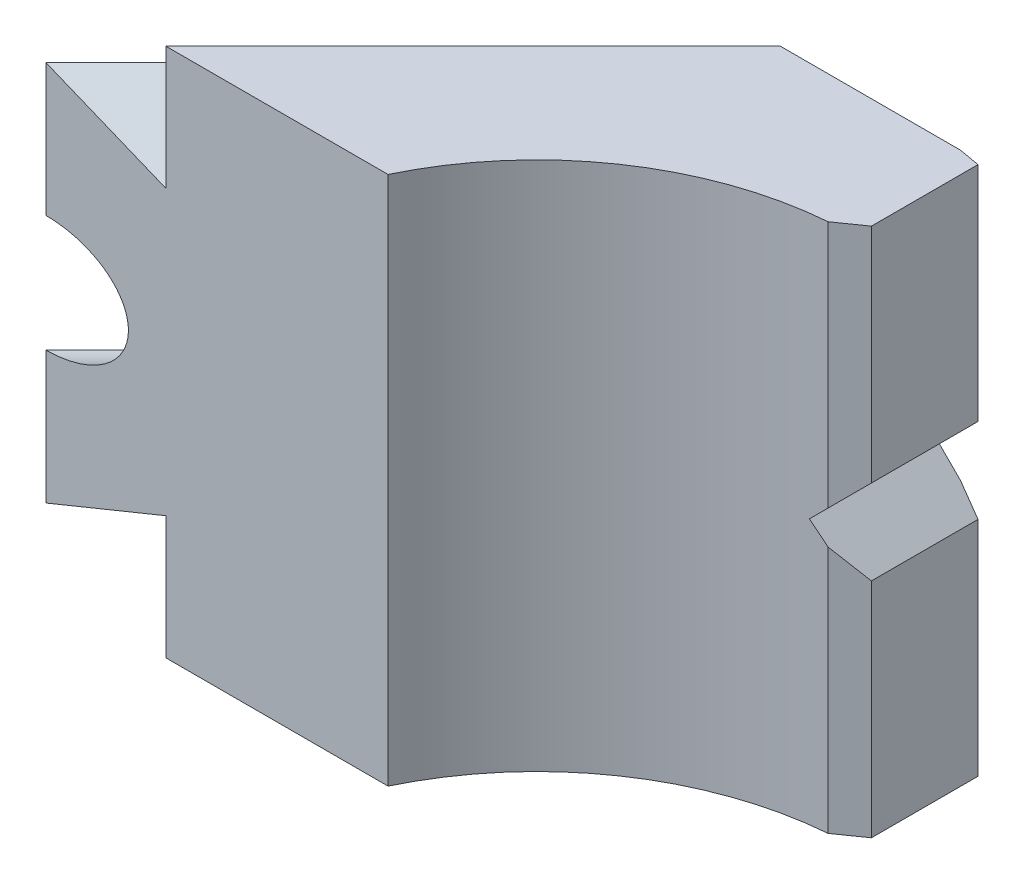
ISO-10303-21;
HEADER;
FILE_DESCRIPTION(('STEP AP214'),'2;1');
FILE_NAME('part.step','',(''),(''),'','','');
FILE_SCHEMA(('AUTOMOTIVE_DESIGN { 1 0 10303 214 1 1 1 1 }'));
ENDSEC;
DATA;
#1=APPLICATION_CONTEXT('core data for automotive mechanical design processes');
#2=APPLICATION_PROTOCOL_DEFINITION('international standard','automotive_design',2000,#1);
#3=PRODUCT_CONTEXT('',#1,'mechanical');
#4=PRODUCT('Part','Part','',(#3));
#5=PRODUCT_RELATED_PRODUCT_CATEGORY('part','',(#4));
#6=PRODUCT_DEFINITION_FORMATION('','',#4);
#7=PRODUCT_DEFINITION_CONTEXT('part definition',#1,'design');
#8=PRODUCT_DEFINITION('design','',#6,#7);
#9=PRODUCT_DEFINITION_SHAPE('','',#8);
#10=(LENGTH_UNIT() NAMED_UNIT(*) SI_UNIT(.MILLI.,.METRE.));
#11=(NAMED_UNIT(*) PLANE_ANGLE_UNIT() SI_UNIT($,.RADIAN.));
#12=(NAMED_UNIT(*) SI_UNIT($,.STERADIAN.) SOLID_ANGLE_UNIT());
#13=UNCERTAINTY_MEASURE_WITH_UNIT(LENGTH_MEASURE(1.E-05),#10,'distance_accuracy_value','');
#14=(GEOMETRIC_REPRESENTATION_CONTEXT(3) GLOBAL_UNCERTAINTY_ASSIGNED_CONTEXT((#13)) GLOBAL_UNIT_ASSIGNED_CONTEXT((#10,
#11,#12)) REPRESENTATION_CONTEXT('',''));
#15=CARTESIAN_POINT('',(0.,0.,0.));
#16=DIRECTION('',(0.,0.,1.));
#17=DIRECTION('',(1.,0.,0.));
#18=AXIS2_PLACEMENT_3D('',#15,#16,#17);
#19=CARTESIAN_POINT('',(-84.343578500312,6.69059892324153,90.0004329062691));
#20=DIRECTION('',(-0.707106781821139,0.,-0.707106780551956));
#21=DIRECTION('',(0.707106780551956,0.,-0.70710678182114));
#22=AXIS2_PLACEMENT_3D('',#19,#20,#21);
#23=PLANE('',#22);
#24=DIRECTION('',(0.,1.,0.));
#25=VECTOR('',#24,1.);
#26=CARTESIAN_POINT('',(5.65685424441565,12.5,0.));
#27=LINE('',#26,#25);
#28=CARTESIAN_POINT('',(5.65685424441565,6.69059892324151,0.));
#29=VERTEX_POINT('',#28);
#30=CARTESIAN_POINT('',(5.65685424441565,12.5,0.));
#31=VERTEX_POINT('',#30);
#32=EDGE_CURVE('E241',#29,#31,#27,.T.);
#33=ORIENTED_EDGE('',*,*,#32,.F.);
#34=DIRECTION('',(0.707106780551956,0.,-0.707106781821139));
#35=VECTOR('',#34,1.);
#36=CARTESIAN_POINT('',(-84.343578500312,6.69059892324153,90.0004329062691));
#37=LINE('',#36,#35);
#38=CARTESIAN_POINT('',(-8.8431457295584,6.69059892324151,14.5));
#39=VERTEX_POINT('',#38);
#40=EDGE_CURVE('E236',#39,#29,#37,.T.);
#41=ORIENTED_EDGE('',*,*,#40,.F.);
#42=DIRECTION('',(0.,-1.,0.));
#43=VECTOR('',#42,1.);
#44=CARTESIAN_POINT('',(-8.8431457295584,12.5,14.5));
#45=LINE('',#44,#43);
#46=CARTESIAN_POINT('',(-8.8431457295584,12.5,14.5));
#47=VERTEX_POINT('',#46);
#48=EDGE_CURVE('E229',#47,#39,#45,.T.);
#49=ORIENTED_EDGE('',*,*,#48,.F.);
#50=DIRECTION('',(-0.707106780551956,0.,0.70710678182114));
#51=VECTOR('',#50,1.);
#52=CARTESIAN_POINT('',(-0.0915728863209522,12.5,5.74842714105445));
#53=LINE('',#52,#51);
#54=EDGE_CURVE('E211',#31,#47,#53,.T.);
#55=ORIENTED_EDGE('',*,*,#54,.F.);
#56=EDGE_LOOP('',(#33,#41,#49,#55));
#57=FACE_BOUND('',#56,.T.);
#58=ADVANCED_FACE('F14',(#57),#23,.T.);
#59=CARTESIAN_POINT('',(-84.343578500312,6.69059892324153,90.0004329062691));
#60=DIRECTION('',(0.353553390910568,0.86602540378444,0.353553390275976));
#61=DIRECTION('',(-0.925820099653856,0.377964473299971,0.));
#62=AXIS2_PLACEMENT_3D('',#59,#60,#61);
#63=PLANE('',#62);
#64=DIRECTION('',(0.925820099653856,-0.377964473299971,0.));
#65=VECTOR('',#64,1.);
#66=CARTESIAN_POINT('',(-1.22474487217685,9.50000000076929,0.));
#67=LINE('',#66,#65);
#68=CARTESIAN_POINT('',(0.,9.,0.));
#69=VERTEX_POINT('',#68);
#70=EDGE_CURVE('E258',#69,#29,#67,.T.);
#71=ORIENTED_EDGE('',*,*,#70,.F.);
#72=DIRECTION('',(0.707106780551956,0.,-0.707106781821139));
#73=VECTOR('',#72,1.);
#74=CARTESIAN_POINT('',(-87.1720056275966,9.,87.1720057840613));
#75=LINE('',#74,#73);
#76=CARTESIAN_POINT('',(-14.499999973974,9.,14.5));
#77=VERTEX_POINT('',#76);
#78=EDGE_CURVE('E238',#77,#69,#75,.T.);
#79=ORIENTED_EDGE('',*,*,#78,.F.);
#80=DIRECTION('',(-0.925820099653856,0.377964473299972,0.));
#81=VECTOR('',#80,1.);
#82=CARTESIAN_POINT('',(-1.88917844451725,3.85165366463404,14.5));
#83=LINE('',#82,#81);
#84=EDGE_CURVE('E22',#39,#77,#83,.T.);
#85=ORIENTED_EDGE('',*,*,#84,.F.);
#86=ORIENTED_EDGE('',*,*,#40,.T.);
#87=EDGE_LOOP('',(#71,#79,#85,#86));
#88=FACE_BOUND('',#87,.T.);
#89=ADVANCED_FACE('F235',(#88),#63,.T.);
#90=CARTESIAN_POINT('',(-84.343578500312,-6.69059892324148,90.0004329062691));
#91=DIRECTION('',(-0.707106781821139,0.,-0.707106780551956));
#92=DIRECTION('',(0.707106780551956,0.,-0.70710678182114));
#93=AXIS2_PLACEMENT_3D('',#90,#91,#92);
#94=PLANE('',#93);
#95=DIRECTION('',(0.,1.,0.));
#96=VECTOR('',#95,1.);
#97=CARTESIAN_POINT('',(5.65685424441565,12.5,0.));
#98=LINE('',#97,#96);
#99=CARTESIAN_POINT('',(5.65685424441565,-12.5,0.));
#100=VERTEX_POINT('',#99);
#101=CARTESIAN_POINT('',(5.6568542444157,-6.69059892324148,0.));
#102=VERTEX_POINT('',#101);
#103=EDGE_CURVE('E29',#100,#102,#98,.T.);
#104=ORIENTED_EDGE('',*,*,#103,.F.);
#105=DIRECTION('',(-0.707106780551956,0.,0.70710678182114));
#106=VECTOR('',#105,1.);
#107=CARTESIAN_POINT('',(-0.0915728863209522,-12.5,5.74842714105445));
#108=LINE('',#107,#106);
#109=CARTESIAN_POINT('',(-8.8431457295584,-12.5,14.5));
#110=VERTEX_POINT('',#109);
#111=EDGE_CURVE('E219',#100,#110,#108,.T.);
#112=ORIENTED_EDGE('',*,*,#111,.T.);
#113=DIRECTION('',(0.,-1.,0.));
#114=VECTOR('',#113,1.);
#115=CARTESIAN_POINT('',(-8.8431457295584,12.5,14.5));
#116=LINE('',#115,#114);
#117=CARTESIAN_POINT('',(-8.8431457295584,-6.69059892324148,14.5));
#118=VERTEX_POINT('',#117);
#119=EDGE_CURVE('E254',#118,#110,#116,.T.);
#120=ORIENTED_EDGE('',*,*,#119,.F.);
#121=DIRECTION('',(0.707106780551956,0.,-0.707106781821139));
#122=VECTOR('',#121,1.);
#123=CARTESIAN_POINT('',(-84.343578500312,-6.69059892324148,90.0004329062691));
#124=LINE('',#123,#122);
#125=EDGE_CURVE('E249',#118,#102,#124,.T.);
#126=ORIENTED_EDGE('',*,*,#125,.T.);
#127=EDGE_LOOP('',(#104,#112,#120,#126));
#128=FACE_BOUND('',#127,.T.);
#129=ADVANCED_FACE('F439',(#128),#94,.T.);
#130=CARTESIAN_POINT('',(-84.343578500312,-6.69059892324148,90.0004329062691));
#131=DIRECTION('',(0.353553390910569,-0.86602540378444,0.353553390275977));
#132=DIRECTION('',(0.925820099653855,0.377964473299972,0.));
#133=AXIS2_PLACEMENT_3D('',#130,#131,#132);
#134=PLANE('',#133);
#135=DIRECTION('',(-0.925820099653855,-0.377964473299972,0.));
#136=VECTOR('',#135,1.);
#137=CARTESIAN_POINT('',(7.52343278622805,-5.92857142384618,0.));
#138=LINE('',#137,#136);
#139=CARTESIAN_POINT('',(0.,-9.,0.));
#140=VERTEX_POINT('',#139);
#141=EDGE_CURVE('E260',#102,#140,#138,.T.);
#142=ORIENTED_EDGE('',*,*,#141,.F.);
#143=ORIENTED_EDGE('',*,*,#125,.F.);
#144=DIRECTION('',(0.925820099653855,0.377964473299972,0.));
#145=VECTOR('',#144,1.);
#146=CARTESIAN_POINT('',(6.8589992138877,-0.280225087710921,14.5));
#147=LINE('',#146,#145);
#148=CARTESIAN_POINT('',(-14.499999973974,-9.,14.5));
#149=VERTEX_POINT('',#148);
#150=EDGE_CURVE('E9',#149,#118,#147,.T.);
#151=ORIENTED_EDGE('',*,*,#150,.F.);
#152=DIRECTION('',(0.707106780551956,0.,-0.707106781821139));
#153=VECTOR('',#152,1.);
#154=CARTESIAN_POINT('',(-87.1720056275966,-9.,87.1720057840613));
#155=LINE('',#154,#153);
#156=EDGE_CURVE('E243',#149,#140,#155,.T.);
#157=ORIENTED_EDGE('',*,*,#156,.T.);
#158=EDGE_LOOP('',(#142,#143,#151,#157));
#159=FACE_BOUND('',#158,.T.);
#160=ADVANCED_FACE('F441',(#159),#134,.T.);
#161=CARTESIAN_POINT('',(-2.01227923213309E-13,12.5,0.));
#162=DIRECTION('',(0.,0.,-1.));
#163=DIRECTION('',(-1.,0.,0.));
#164=AXIS2_PLACEMENT_3D('',#161,#162,#163);
#165=PLANE('',#164);
#166=DIRECTION('',(0.,-1.,0.));
#167=VECTOR('',#166,1.);
#168=CARTESIAN_POINT('',(14.1599999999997,12.5,0.));
#169=LINE('',#168,#167);
#170=CARTESIAN_POINT('',(14.1599999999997,-1.,0.));
#171=VERTEX_POINT('',#170);
#172=CARTESIAN_POINT('',(14.1599999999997,-12.5,0.));
#173=VERTEX_POINT('',#172);
#174=EDGE_CURVE('E321',#171,#173,#169,.T.);
#175=ORIENTED_EDGE('',*,*,#174,.T.);
#176=DIRECTION('',(1.,0.,0.));
#177=VECTOR('',#176,1.);
#178=CARTESIAN_POINT('',(-2.01227923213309E-13,-12.5,0.));
#179=LINE('',#178,#177);
#180=EDGE_CURVE('E301',#100,#173,#179,.T.);
#181=ORIENTED_EDGE('',*,*,#180,.F.);
#182=ORIENTED_EDGE('',*,*,#103,.T.);
#183=ORIENTED_EDGE('',*,*,#141,.T.);
#184=DIRECTION('',(0.,-1.,0.));
#185=VECTOR('',#184,1.);
#186=CARTESIAN_POINT('',(-2.01227923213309E-13,12.5,0.));
#187=LINE('',#186,#185);
#188=EDGE_CURVE('E37',#69,#140,#187,.T.);
#189=ORIENTED_EDGE('',*,*,#188,.F.);
#190=ORIENTED_EDGE('',*,*,#70,.T.);
#191=ORIENTED_EDGE('',*,*,#32,.T.);
#192=DIRECTION('',(1.,0.,0.));
#193=VECTOR('',#192,1.);
#194=CARTESIAN_POINT('',(-2.01227923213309E-13,12.5,0.));
#195=LINE('',#194,#193);
#196=CARTESIAN_POINT('',(14.1599999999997,12.5,0.));
#197=VERTEX_POINT('',#196);
#198=EDGE_CURVE('E316',#31,#197,#195,.T.);
#199=ORIENTED_EDGE('',*,*,#198,.T.);
#200=CARTESIAN_POINT('',(14.1599999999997,0.999999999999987,0.));
#201=VERTEX_POINT('',#200);
#202=EDGE_CURVE('E322',#197,#201,#169,.T.);
#203=ORIENTED_EDGE('',*,*,#202,.T.);
#204=DIRECTION('',(-0.707106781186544,-0.707106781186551,0.));
#205=VECTOR('',#204,1.);
#206=CARTESIAN_POINT('',(15.4999999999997,2.34,0.));
#207=LINE('',#206,#205);
#208=CARTESIAN_POINT('',(13.1599999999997,0.,0.));
#209=VERTEX_POINT('',#208);
#210=EDGE_CURVE('E262',#201,#209,#207,.T.);
#211=ORIENTED_EDGE('',*,*,#210,.T.);
#212=DIRECTION('',(-0.707106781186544,0.707106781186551,0.));
#213=VECTOR('',#212,1.);
#214=CARTESIAN_POINT('',(15.4999999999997,-2.34,0.));
#215=LINE('',#214,#213);
#216=EDGE_CURVE('E263',#171,#209,#215,.T.);
#217=ORIENTED_EDGE('',*,*,#216,.F.);
#218=EDGE_LOOP('',(#175,#181,#182,#183,#189,#190,#191,#199,#203,#211,#217));
#219=FACE_BOUND('',#218,.T.);
#220=ADVANCED_FACE('F445',(#219),#165,.T.);
#221=CARTESIAN_POINT('',(1.6414941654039,12.5,14.5));
#222=DIRECTION('',(0.,0.,1.));
#223=DIRECTION('',(1.,0.,0.));
#224=AXIS2_PLACEMENT_3D('',#221,#222,#223);
#225=PLANE('',#224);
#226=ORIENTED_EDGE('',*,*,#150,.T.);
#227=ORIENTED_EDGE('',*,*,#119,.T.);
#228=DIRECTION('',(-1.,0.,0.));
#229=VECTOR('',#228,1.);
#230=CARTESIAN_POINT('',(1.6414941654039,-12.5,14.5));
#231=LINE('',#230,#229);
#232=CARTESIAN_POINT('',(1.6414941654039,-12.5,14.5));
#233=VERTEX_POINT('',#232);
#234=EDGE_CURVE('E289',#233,#110,#231,.T.);
#235=ORIENTED_EDGE('',*,*,#234,.F.);
#236=DIRECTION('',(0.,-1.,0.));
#237=VECTOR('',#236,1.);
#238=CARTESIAN_POINT('',(1.6414941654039,12.5,14.5));
#239=LINE('',#238,#237);
#240=CARTESIAN_POINT('',(1.6414941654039,12.5,14.5));
#241=VERTEX_POINT('',#240);
#242=EDGE_CURVE('E196',#241,#233,#239,.T.);
#243=ORIENTED_EDGE('',*,*,#242,.F.);
#244=DIRECTION('',(-1.,0.,0.));
#245=VECTOR('',#244,1.);
#246=CARTESIAN_POINT('',(1.6414941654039,12.5,14.5));
#247=LINE('',#246,#245);
#248=EDGE_CURVE('E292',#241,#47,#247,.T.);
#249=ORIENTED_EDGE('',*,*,#248,.T.);
#250=ORIENTED_EDGE('',*,*,#48,.T.);
#251=ORIENTED_EDGE('',*,*,#84,.T.);
#252=DIRECTION('',(0.,-1.,0.));
#253=VECTOR('',#252,1.);
#254=CARTESIAN_POINT('',(-14.5000000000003,12.5,14.5));
#255=LINE('',#254,#253);
#256=CARTESIAN_POINT('',(-14.5000000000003,2.75,14.5));
#257=VERTEX_POINT('',#256);
#258=EDGE_CURVE('E226',#77,#257,#255,.T.);
#259=ORIENTED_EDGE('',*,*,#258,.T.);
#260=CARTESIAN_POINT('',(-14.5000000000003,0.,14.5));
#261=DIRECTION('',(0.,0.,1.));
#262=DIRECTION('',(-1.,0.,0.));
#263=AXIS2_PLACEMENT_3D('',#260,#261,#262);
#264=ELLIPSE('',#263,3.88908729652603,2.75);
#265=CARTESIAN_POINT('',(-14.5000000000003,-2.75,14.5));
#266=VERTEX_POINT('',#265);
#267=EDGE_CURVE('E287',#266,#257,#264,.T.);
#268=ORIENTED_EDGE('',*,*,#267,.F.);
#269=EDGE_CURVE('E306',#266,#149,#255,.T.);
#270=ORIENTED_EDGE('',*,*,#269,.T.);
#271=EDGE_LOOP('',(#226,#227,#235,#243,#249,#250,#251,#259,#268,#270));
#272=FACE_BOUND('',#271,.T.);
#273=ADVANCED_FACE('F224',(#272),#225,.T.);
#274=CARTESIAN_POINT('',(15.1599999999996,-12.5,21.));
#275=DIRECTION('',(0.,1.,0.));
#276=DIRECTION('',(0.,0.,1.));
#277=AXIS2_PLACEMENT_3D('',#274,#275,#276);
#278=PLANE('',#277);
#279=ORIENTED_EDGE('',*,*,#180,.T.);
#280=DIRECTION('',(0.984807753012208,0.,0.173648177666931));
#281=VECTOR('',#280,1.);
#282=CARTESIAN_POINT('',(14.1599999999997,-12.5,0.));
#283=LINE('',#282,#281);
#284=CARTESIAN_POINT('',(15.1599999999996,-12.5,0.176326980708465));
#285=VERTEX_POINT('',#284);
#286=EDGE_CURVE('E298',#173,#285,#283,.T.);
#287=ORIENTED_EDGE('',*,*,#286,.T.);
#288=DIRECTION('',(0.,0.,1.));
#289=VECTOR('',#288,1.);
#290=CARTESIAN_POINT('',(15.1599999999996,-12.5,0.176326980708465));
#291=LINE('',#290,#289);
#292=CARTESIAN_POINT('',(15.1599999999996,-12.5,5.20593053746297));
#293=VERTEX_POINT('',#292);
#294=EDGE_CURVE('E296',#285,#293,#291,.T.);
#295=ORIENTED_EDGE('',*,*,#294,.T.);
#296=DIRECTION('',(-0.81915204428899,0.,0.573576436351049));
#297=VECTOR('',#296,1.);
#298=CARTESIAN_POINT('',(15.1599999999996,-12.5,5.20593053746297));
#299=LINE('',#298,#297);
#300=CARTESIAN_POINT('',(13.9569388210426,-12.5,6.04832304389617));
#301=VERTEX_POINT('',#300);
#302=EDGE_CURVE('E293',#293,#301,#299,.T.);
#303=ORIENTED_EDGE('',*,*,#302,.T.);
#304=CARTESIAN_POINT('',(15.1599999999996,-12.5,21.));
#305=DIRECTION('',(0.,1.,0.));
#306=DIRECTION('',(0.,0.,1.));
#307=AXIS2_PLACEMENT_3D('',#304,#305,#306);
#308=CIRCLE('',#307,15.);
#309=EDGE_CURVE('E290',#301,#233,#308,.T.);
#310=ORIENTED_EDGE('',*,*,#309,.T.);
#311=ORIENTED_EDGE('',*,*,#234,.T.);
#312=ORIENTED_EDGE('',*,*,#111,.F.);
#313=EDGE_LOOP('',(#279,#287,#295,#303,#310,#311,#312));
#314=FACE_BOUND('',#313,.T.);
#315=ADVANCED_FACE('F463',(#314),#278,.F.);
#316=CARTESIAN_POINT('',(15.1599999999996,12.5,21.));
#317=DIRECTION('',(0.,1.,0.));
#318=DIRECTION('',(0.,0.,1.));
#319=AXIS2_PLACEMENT_3D('',#316,#317,#318);
#320=PLANE('',#319);
#321=ORIENTED_EDGE('',*,*,#248,.F.);
#322=CARTESIAN_POINT('',(15.1599999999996,12.5,21.));
#323=DIRECTION('',(0.,1.,0.));
#324=DIRECTION('',(0.,0.,1.));
#325=AXIS2_PLACEMENT_3D('',#322,#323,#324);
#326=CIRCLE('',#325,15.);
#327=CARTESIAN_POINT('',(13.9569388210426,12.5,6.04832304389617));
#328=VERTEX_POINT('',#327);
#329=EDGE_CURVE('E304',#328,#241,#326,.T.);
#330=ORIENTED_EDGE('',*,*,#329,.F.);
#331=DIRECTION('',(-0.81915204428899,0.,0.573576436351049));
#332=VECTOR('',#331,1.);
#333=CARTESIAN_POINT('',(15.1599999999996,12.5,5.20593053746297));
#334=LINE('',#333,#332);
#335=CARTESIAN_POINT('',(15.1599999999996,12.5,5.20593053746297));
#336=VERTEX_POINT('',#335);
#337=EDGE_CURVE('E307',#336,#328,#334,.T.);
#338=ORIENTED_EDGE('',*,*,#337,.F.);
#339=DIRECTION('',(0.,0.,1.));
#340=VECTOR('',#339,1.);
#341=CARTESIAN_POINT('',(15.1599999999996,12.5,4.60593053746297));
#342=LINE('',#341,#340);
#343=CARTESIAN_POINT('',(15.1599999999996,12.5,0.176326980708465));
#344=VERTEX_POINT('',#343);
#345=EDGE_CURVE('E310',#344,#336,#342,.T.);
#346=ORIENTED_EDGE('',*,*,#345,.F.);
#347=DIRECTION('',(0.984807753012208,0.,0.173648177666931));
#348=VECTOR('',#347,1.);
#349=CARTESIAN_POINT('',(14.1599999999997,12.5,0.));
#350=LINE('',#349,#348);
#351=EDGE_CURVE('E313',#197,#344,#350,.T.);
#352=ORIENTED_EDGE('',*,*,#351,.F.);
#353=ORIENTED_EDGE('',*,*,#198,.F.);
#354=ORIENTED_EDGE('',*,*,#54,.T.);
#355=EDGE_LOOP('',(#321,#330,#338,#346,#352,#353,#354));
#356=FACE_BOUND('',#355,.T.);
#357=ADVANCED_FACE('F466',(#356),#320,.T.);
#358=CARTESIAN_POINT('',(-14.5000000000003,12.5,14.5));
#359=DIRECTION('',(-0.707106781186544,0.,-0.707106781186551));
#360=DIRECTION('',(-0.707106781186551,0.,0.707106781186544));
#361=AXIS2_PLACEMENT_3D('',#358,#359,#360);
#362=PLANE('',#361);
#363=DIRECTION('',(0.,1.,0.));
#364=VECTOR('',#363,1.);
#365=CARTESIAN_POINT('',(-9.9038059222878,12.5,9.90380592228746));
#366=LINE('',#365,#364);
#367=CARTESIAN_POINT('',(-9.9038059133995,-5.,9.9038059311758));
#368=VERTEX_POINT('',#367);
#369=CARTESIAN_POINT('',(-9.9038059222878,-2.75,9.90380592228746));
#370=VERTEX_POINT('',#369);
#371=EDGE_CURVE('E202',#368,#370,#366,.T.);
#372=ORIENTED_EDGE('',*,*,#371,.F.);
#373=DIRECTION('',(0.707106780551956,0.,-0.70710678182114));
#374=VECTOR('',#373,1.);
#375=CARTESIAN_POINT('',(-9.9038058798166,-5.00000000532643,9.90380589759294));
#376=LINE('',#375,#374);
#377=CARTESIAN_POINT('',(-2.83273807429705,-5.00000000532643,2.83273807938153));
#378=VERTEX_POINT('',#377);
#379=EDGE_CURVE('E199',#378,#368,#376,.F.);
#380=ORIENTED_EDGE('',*,*,#379,.F.);
#381=DIRECTION('',(0.,-1.,0.));
#382=VECTOR('',#381,1.);
#383=CARTESIAN_POINT('',(-2.8327381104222,12.5,2.83273811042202));
#384=LINE('',#383,#382);
#385=CARTESIAN_POINT('',(-2.8327381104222,5.,2.83273811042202));
#386=VERTEX_POINT('',#385);
#387=EDGE_CURVE('E189',#386,#378,#384,.T.);
#388=ORIENTED_EDGE('',*,*,#387,.F.);
#389=DIRECTION('',(0.707106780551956,0.,-0.70710678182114));
#390=VECTOR('',#389,1.);
#391=CARTESIAN_POINT('',(-9.9038058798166,4.99999999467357,9.90380589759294));
#392=LINE('',#391,#390);
#393=CARTESIAN_POINT('',(-9.9038058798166,5.,9.90380589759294));
#394=VERTEX_POINT('',#393);
#395=EDGE_CURVE('E206',#394,#386,#392,.T.);
#396=ORIENTED_EDGE('',*,*,#395,.F.);
#397=CARTESIAN_POINT('',(-9.9038058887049,2.75,9.9038058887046));
#398=VERTEX_POINT('',#397);
#399=EDGE_CURVE('E195',#398,#394,#366,.T.);
#400=ORIENTED_EDGE('',*,*,#399,.F.);
#401=DIRECTION('',(-0.707106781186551,0.,0.707106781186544));
#402=VECTOR('',#401,1.);
#403=CARTESIAN_POINT('',(-21.3921356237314,2.75,21.3921356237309));
#404=LINE('',#403,#402);
#405=EDGE_CURVE('E340',#257,#398,#404,.F.);
#406=ORIENTED_EDGE('',*,*,#405,.F.);
#407=ORIENTED_EDGE('',*,*,#258,.F.);
#408=ORIENTED_EDGE('',*,*,#78,.T.);
#409=ORIENTED_EDGE('',*,*,#188,.T.);
#410=ORIENTED_EDGE('',*,*,#156,.F.);
#411=ORIENTED_EDGE('',*,*,#269,.F.);
#412=DIRECTION('',(-0.707106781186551,0.,0.707106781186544));
#413=VECTOR('',#412,1.);
#414=CARTESIAN_POINT('',(-21.3921356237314,-2.75,21.3921356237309));
#415=LINE('',#414,#413);
#416=EDGE_CURVE('E343',#370,#266,#415,.T.);
#417=ORIENTED_EDGE('',*,*,#416,.F.);
#418=EDGE_LOOP('',(#372,#380,#388,#396,#400,#406,#407,#408,#409,#410,#411,#417));
#419=FACE_BOUND('',#418,.T.);
#420=ADVANCED_FACE('F200',(#419),#362,.T.);
#421=CARTESIAN_POINT('',(15.1599999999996,12.5,21.));
#422=DIRECTION('',(0.,-1.,0.));
#423=DIRECTION('',(0.,0.,-1.));
#424=AXIS2_PLACEMENT_3D('',#421,#422,#423);
#425=CYLINDRICAL_SURFACE('',#424,15.);
#426=ORIENTED_EDGE('',*,*,#242,.T.);
#427=ORIENTED_EDGE('',*,*,#309,.F.);
#428=DIRECTION('',(0.,-1.,0.));
#429=VECTOR('',#428,1.);
#430=CARTESIAN_POINT('',(13.9569388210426,12.5,6.04832304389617));
#431=LINE('',#430,#429);
#432=CARTESIAN_POINT('',(13.9569388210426,-0.796938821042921,6.04832304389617));
#433=VERTEX_POINT('',#432);
#434=EDGE_CURVE('E333',#433,#301,#431,.T.);
#435=ORIENTED_EDGE('',*,*,#434,.F.);
#436=CARTESIAN_POINT('',(15.1599999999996,-2.,21.));
#437=DIRECTION('',(-0.707106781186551,-0.707106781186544,0.));
#438=DIRECTION('',(0.707106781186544,-0.707106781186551,0.));
#439=AXIS2_PLACEMENT_3D('',#436,#437,#438);
#440=ELLIPSE('',#439,21.2132034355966,15.);
#441=CARTESIAN_POINT('',(13.1599999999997,0.,6.13393125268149));
#442=VERTEX_POINT('',#441);
#443=EDGE_CURVE('E274',#442,#433,#440,.T.);
#444=ORIENTED_EDGE('',*,*,#443,.F.);
#445=CARTESIAN_POINT('',(15.1599999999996,2.,21.));
#446=DIRECTION('',(0.707106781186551,-0.707106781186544,0.));
#447=DIRECTION('',(-0.707106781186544,-0.707106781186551,0.));
#448=AXIS2_PLACEMENT_3D('',#445,#446,#447);
#449=ELLIPSE('',#448,21.2132034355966,15.);
#450=CARTESIAN_POINT('',(13.9569388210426,0.796938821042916,6.04832304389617));
#451=VERTEX_POINT('',#450);
#452=EDGE_CURVE('E281',#442,#451,#449,.T.);
#453=ORIENTED_EDGE('',*,*,#452,.T.);
#454=EDGE_CURVE('E334',#328,#451,#431,.T.);
#455=ORIENTED_EDGE('',*,*,#454,.F.);
#456=ORIENTED_EDGE('',*,*,#329,.T.);
#457=EDGE_LOOP('',(#426,#427,#435,#444,#453,#455,#456));
#458=FACE_BOUND('',#457,.T.);
#459=ADVANCED_FACE('F475',(#458),#425,.F.);
#460=CARTESIAN_POINT('',(15.1599999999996,12.5,5.20593053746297));
#461=DIRECTION('',(0.573576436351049,0.,0.81915204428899));
#462=DIRECTION('',(0.81915204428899,0.,-0.573576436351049));
#463=AXIS2_PLACEMENT_3D('',#460,#461,#462);
#464=PLANE('',#463);
#465=ORIENTED_EDGE('',*,*,#454,.T.);
#466=DIRECTION('',(0.633687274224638,0.633687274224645,-0.443712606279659));
#467=VECTOR('',#466,1.);
#468=CARTESIAN_POINT('',(19.3763753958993,6.21637539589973,2.25359270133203));
#469=LINE('',#468,#467);
#470=CARTESIAN_POINT('',(15.1599999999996,2.,5.20593053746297));
#471=VERTEX_POINT('',#470);
#472=EDGE_CURVE('E278',#451,#471,#469,.T.);
#473=ORIENTED_EDGE('',*,*,#472,.T.);
#474=DIRECTION('',(0.,-1.,0.));
#475=VECTOR('',#474,1.);
#476=CARTESIAN_POINT('',(15.1599999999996,12.5,5.20593053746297));
#477=LINE('',#476,#475);
#478=EDGE_CURVE('E330',#336,#471,#477,.T.);
#479=ORIENTED_EDGE('',*,*,#478,.F.);
#480=ORIENTED_EDGE('',*,*,#337,.T.);
#481=EDGE_LOOP('',(#465,#473,#479,#480));
#482=FACE_BOUND('',#481,.T.);
#483=ADVANCED_FACE('F491',(#482),#464,.T.);
#484=CARTESIAN_POINT('',(15.1599999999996,12.5,4.60593053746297));
#485=DIRECTION('',(1.,0.,0.));
#486=DIRECTION('',(0.,0.,-1.));
#487=AXIS2_PLACEMENT_3D('',#484,#485,#486);
#488=PLANE('',#487);
#489=ORIENTED_EDGE('',*,*,#478,.T.);
#490=DIRECTION('',(0.,0.,-1.));
#491=VECTOR('',#490,1.);
#492=CARTESIAN_POINT('',(15.1599999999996,2.,4.6059305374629));
#493=LINE('',#492,#491);
#494=CARTESIAN_POINT('',(15.1599999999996,2.,0.176326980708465));
#495=VERTEX_POINT('',#494);
#496=EDGE_CURVE('E276',#471,#495,#493,.T.);
#497=ORIENTED_EDGE('',*,*,#496,.T.);
#498=DIRECTION('',(0.,-1.,0.));
#499=VECTOR('',#498,1.);
#500=CARTESIAN_POINT('',(15.1599999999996,12.5,0.176326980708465));
#501=LINE('',#500,#499);
#502=EDGE_CURVE('E326',#344,#495,#501,.T.);
#503=ORIENTED_EDGE('',*,*,#502,.F.);
#504=ORIENTED_EDGE('',*,*,#345,.T.);
#505=EDGE_LOOP('',(#489,#497,#503,#504));
#506=FACE_BOUND('',#505,.T.);
#507=ADVANCED_FACE('F487',(#506),#488,.T.);
#508=CARTESIAN_POINT('',(14.1599999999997,12.5,0.));
#509=DIRECTION('',(0.173648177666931,0.,-0.984807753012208));
#510=DIRECTION('',(-0.984807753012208,0.,-0.173648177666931));
#511=AXIS2_PLACEMENT_3D('',#508,#509,#510);
#512=PLANE('',#511);
#513=ORIENTED_EDGE('',*,*,#502,.T.);
#514=DIRECTION('',(-0.70167384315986,-0.701673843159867,-0.123724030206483));
#515=VECTOR('',#514,1.);
#516=CARTESIAN_POINT('',(19.8219810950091,6.66198109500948,0.998360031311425));
#517=LINE('',#516,#515);
#518=EDGE_CURVE('E347',#495,#201,#517,.T.);
#519=ORIENTED_EDGE('',*,*,#518,.T.);
#520=ORIENTED_EDGE('',*,*,#202,.F.);
#521=ORIENTED_EDGE('',*,*,#351,.T.);
#522=EDGE_LOOP('',(#513,#519,#520,#521));
#523=FACE_BOUND('',#522,.T.);
#524=ADVANCED_FACE('F482',(#523),#512,.T.);
#525=DIRECTION('',(0.633687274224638,-0.633687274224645,-0.443712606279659));
#526=VECTOR('',#525,1.);
#527=CARTESIAN_POINT('',(9.33738635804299,3.82261364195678,9.2829685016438));
#528=LINE('',#527,#526);
#529=CARTESIAN_POINT('',(15.1599999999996,-2.,5.20593053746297));
#530=VERTEX_POINT('',#529);
#531=EDGE_CURVE('E272',#433,#530,#528,.T.);
#532=ORIENTED_EDGE('',*,*,#531,.F.);
#533=ORIENTED_EDGE('',*,*,#434,.T.);
#534=ORIENTED_EDGE('',*,*,#302,.F.);
#535=EDGE_CURVE('E329',#530,#293,#477,.T.);
#536=ORIENTED_EDGE('',*,*,#535,.F.);
#537=EDGE_LOOP('',(#532,#533,#534,#536));
#538=FACE_BOUND('',#537,.T.);
#539=ADVANCED_FACE('F485',(#538),#464,.T.);
#540=DIRECTION('',(0.,0.,-1.));
#541=VECTOR('',#540,1.);
#542=CARTESIAN_POINT('',(15.1599999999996,-2.,4.60593053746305));
#543=LINE('',#542,#541);
#544=CARTESIAN_POINT('',(15.1599999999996,-2.,0.176326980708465));
#545=VERTEX_POINT('',#544);
#546=EDGE_CURVE('E270',#530,#545,#543,.T.);
#547=ORIENTED_EDGE('',*,*,#546,.F.);
#548=ORIENTED_EDGE('',*,*,#535,.T.);
#549=ORIENTED_EDGE('',*,*,#294,.F.);
#550=EDGE_CURVE('E325',#545,#285,#501,.T.);
#551=ORIENTED_EDGE('',*,*,#550,.F.);
#552=EDGE_LOOP('',(#547,#548,#549,#551));
#553=FACE_BOUND('',#552,.T.);
#554=ADVANCED_FACE('F480',(#553),#488,.T.);
#555=DIRECTION('',(-0.70167384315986,0.701673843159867,-0.123724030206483));
#556=VECTOR('',#555,1.);
#557=CARTESIAN_POINT('',(7.5133265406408,5.64667345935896,-1.17198786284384));
#558=LINE('',#557,#556);
#559=EDGE_CURVE('E345',#545,#171,#558,.T.);
#560=ORIENTED_EDGE('',*,*,#559,.F.);
#561=ORIENTED_EDGE('',*,*,#550,.T.);
#562=ORIENTED_EDGE('',*,*,#286,.F.);
#563=ORIENTED_EDGE('',*,*,#174,.F.);
#564=EDGE_LOOP('',(#560,#561,#562,#563));
#565=FACE_BOUND('',#564,.T.);
#566=ADVANCED_FACE('F461',(#565),#512,.T.);
#567=CARTESIAN_POINT('',(-21.3921356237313,0.,21.3921356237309));
#568=DIRECTION('',(-0.707106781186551,0.,0.707106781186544));
#569=DIRECTION('',(0.707106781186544,0.,0.707106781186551));
#570=AXIS2_PLACEMENT_3D('',#567,#568,#569);
#571=CYLINDRICAL_SURFACE('',#570,2.75);
#572=ORIENTED_EDGE('',*,*,#416,.T.);
#573=ORIENTED_EDGE('',*,*,#267,.T.);
#574=ORIENTED_EDGE('',*,*,#405,.T.);
#575=CARTESIAN_POINT('',(-9.9038059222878,0.,9.90380592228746));
#576=DIRECTION('',(-0.707106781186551,0.,0.707106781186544));
#577=DIRECTION('',(0.707106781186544,0.,0.707106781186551));
#578=AXIS2_PLACEMENT_3D('',#575,#576,#577);
#579=CIRCLE('',#578,2.75);
#580=EDGE_CURVE('E284',#370,#398,#579,.T.);
#581=ORIENTED_EDGE('',*,*,#580,.F.);
#582=EDGE_LOOP('',(#572,#573,#574,#581));
#583=FACE_BOUND('',#582,.T.);
#584=ADVANCED_FACE('F457',(#583),#571,.F.);
#585=CARTESIAN_POINT('',(15.4999999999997,2.34,15.));
#586=DIRECTION('',(0.707106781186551,-0.707106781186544,0.));
#587=DIRECTION('',(0.707106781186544,0.707106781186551,0.));
#588=AXIS2_PLACEMENT_3D('',#585,#586,#587);
#589=PLANE('',#588);
#590=DIRECTION('',(0.,0.,-1.));
#591=VECTOR('',#590,1.);
#592=CARTESIAN_POINT('',(13.1599999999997,0.,15.));
#593=LINE('',#592,#591);
#594=EDGE_CURVE('E266',#442,#209,#593,.T.);
#595=ORIENTED_EDGE('',*,*,#594,.T.);
#596=ORIENTED_EDGE('',*,*,#210,.F.);
#597=ORIENTED_EDGE('',*,*,#518,.F.);
#598=ORIENTED_EDGE('',*,*,#496,.F.);
#599=ORIENTED_EDGE('',*,*,#472,.F.);
#600=ORIENTED_EDGE('',*,*,#452,.F.);
#601=EDGE_LOOP('',(#595,#596,#597,#598,#599,#600));
#602=FACE_BOUND('',#601,.T.);
#603=ADVANCED_FACE('F453',(#602),#589,.T.);
#604=CARTESIAN_POINT('',(15.4999999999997,-2.34,15.));
#605=DIRECTION('',(-0.707106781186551,-0.707106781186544,0.));
#606=DIRECTION('',(0.707106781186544,-0.707106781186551,0.));
#607=AXIS2_PLACEMENT_3D('',#604,#605,#606);
#608=PLANE('',#607);
#609=ORIENTED_EDGE('',*,*,#443,.T.);
#610=ORIENTED_EDGE('',*,*,#531,.T.);
#611=ORIENTED_EDGE('',*,*,#546,.T.);
#612=ORIENTED_EDGE('',*,*,#559,.T.);
#613=ORIENTED_EDGE('',*,*,#216,.T.);
#614=ORIENTED_EDGE('',*,*,#594,.F.);
#615=EDGE_LOOP('',(#609,#610,#611,#612,#613,#614));
#616=FACE_BOUND('',#615,.T.);
#617=ADVANCED_FACE('F450',(#616),#608,.F.);
#618=CARTESIAN_POINT('',(-2.8327381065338,-5.32643138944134E-09,2.83273804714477));
#619=DIRECTION('',(-0.707106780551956,0.,0.70710678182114));
#620=DIRECTION('',(0.70710678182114,0.,0.707106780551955));
#621=AXIS2_PLACEMENT_3D('',#618,#619,#620);
#622=PLANE('',#621);
#623=CARTESIAN_POINT('',(-2.8327381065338,-5.32643138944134E-09,2.83273804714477));
#624=DIRECTION('',(-0.707106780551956,0.,0.70710678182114));
#625=DIRECTION('',(0.70710678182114,0.,0.707106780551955));
#626=AXIS2_PLACEMENT_3D('',#623,#624,#625);
#627=CIRCLE('',#626,5.);
#628=EDGE_CURVE('E193',#386,#378,#627,.T.);
#629=ORIENTED_EDGE('',*,*,#628,.F.);
#630=ORIENTED_EDGE('',*,*,#387,.T.);
#631=EDGE_LOOP('',(#629,#630));
#632=FACE_BOUND('',#631,.T.);
#633=ADVANCED_FACE('F191',(#632),#622,.F.);
#634=CARTESIAN_POINT('',(-9.9038059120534,-5.3264297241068E-09,9.90380586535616));
#635=DIRECTION('',(0.707106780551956,0.,-0.70710678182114));
#636=DIRECTION('',(-0.70710678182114,0.,-0.707106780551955));
#637=AXIS2_PLACEMENT_3D('',#634,#635,#636);
#638=CYLINDRICAL_SURFACE('',#637,5.);
#639=CARTESIAN_POINT('',(-9.9038059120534,-5.3264297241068E-09,9.90380586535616));
#640=DIRECTION('',(-0.707106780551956,0.,0.70710678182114));
#641=DIRECTION('',(0.70710678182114,0.,0.707106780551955));
#642=AXIS2_PLACEMENT_3D('',#639,#640,#641);
#643=CIRCLE('',#642,5.);
#644=EDGE_CURVE('E208',#394,#368,#643,.T.);
#645=ORIENTED_EDGE('',*,*,#644,.F.);
#646=ORIENTED_EDGE('',*,*,#395,.T.);
#647=ORIENTED_EDGE('',*,*,#628,.T.);
#648=ORIENTED_EDGE('',*,*,#379,.T.);
#649=EDGE_LOOP('',(#645,#646,#647,#648));
#650=FACE_BOUND('',#649,.T.);
#651=ADVANCED_FACE('F16',(#650),#638,.T.);
#652=CARTESIAN_POINT('',(-7.0753787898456,-2.30940108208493,7.07537873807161));
#653=DIRECTION('',(0.35355339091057,0.866025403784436,0.353553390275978));
#654=DIRECTION('',(-0.612372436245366,0.5,-0.61237243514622));
#655=AXIS2_PLACEMENT_3D('',#652,#653,#654);
#656=PLANE('',#655);
#657=DIRECTION('',(-0.707106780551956,0.,0.70710678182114));
#658=VECTOR('',#657,1.);
#659=CARTESIAN_POINT('',(-8.4895923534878,-1.15470054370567,5.6611651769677));
#660=LINE('',#659,#658);
#661=CARTESIAN_POINT('',(-8.4895923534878,-1.15470054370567,5.6611651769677));
#662=VERTEX_POINT('',#661);
#663=CARTESIAN_POINT('',(-11.3180194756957,-1.15470054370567,8.48959230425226));
#664=VERTEX_POINT('',#663);
#665=EDGE_CURVE('E209',#662,#664,#660,.T.);
#666=ORIENTED_EDGE('',*,*,#665,.T.);
#667=DIRECTION('',(-0.612372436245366,0.5,-0.61237243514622));
#668=VECTOR('',#667,1.);
#669=CARTESIAN_POINT('',(-9.9038059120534,-2.30940108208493,9.90380586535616));
#670=LINE('',#669,#668);
#671=CARTESIAN_POINT('',(-9.9038059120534,-2.30940108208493,9.90380586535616));
#672=VERTEX_POINT('',#671);
#673=EDGE_CURVE('E350',#672,#664,#670,.T.);
#674=ORIENTED_EDGE('',*,*,#673,.F.);
#675=DIRECTION('',(-0.707106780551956,0.,0.70710678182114));
#676=VECTOR('',#675,1.);
#677=CARTESIAN_POINT('',(-7.0753787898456,-2.30940108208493,7.07537873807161));
#678=LINE('',#677,#676);
#679=CARTESIAN_POINT('',(-7.0753787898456,-2.30940108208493,7.07537873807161));
#680=VERTEX_POINT('',#679);
#681=EDGE_CURVE('E372',#680,#672,#678,.T.);
#682=ORIENTED_EDGE('',*,*,#681,.F.);
#683=DIRECTION('',(-0.612372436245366,0.5,-0.61237243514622));
#684=VECTOR('',#683,1.);
#685=CARTESIAN_POINT('',(-7.0753787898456,-2.30940108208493,7.07537873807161));
#686=LINE('',#685,#684);
#687=EDGE_CURVE('E354',#680,#662,#686,.T.);
#688=ORIENTED_EDGE('',*,*,#687,.T.);
#689=EDGE_LOOP('',(#666,#674,#682,#688));
#690=FACE_BOUND('',#689,.T.);
#691=ADVANCED_FACE('F408',(#690),#656,.T.);
#692=CARTESIAN_POINT('',(-8.4895923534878,1.15470053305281,5.6611651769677));
#693=DIRECTION('',(-0.70710678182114,0.,-0.707106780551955));
#694=DIRECTION('',(-0.707106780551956,0.,0.70710678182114));
#695=AXIS2_PLACEMENT_3D('',#692,#693,#694);
#696=PLANE('',#695);
#697=DIRECTION('',(-0.707106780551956,0.,0.70710678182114));
#698=VECTOR('',#697,1.);
#699=CARTESIAN_POINT('',(-8.4895923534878,1.15470053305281,5.6611651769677));
#700=LINE('',#699,#698);
#701=CARTESIAN_POINT('',(-8.4895923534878,1.15470053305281,5.6611651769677));
#702=VERTEX_POINT('',#701);
#703=CARTESIAN_POINT('',(-11.3180194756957,1.15470053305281,8.48959230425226));
#704=VERTEX_POINT('',#703);
#705=EDGE_CURVE('E213',#702,#704,#700,.T.);
#706=ORIENTED_EDGE('',*,*,#705,.T.);
#707=DIRECTION('',(0.,-1.,0.));
#708=VECTOR('',#707,1.);
#709=CARTESIAN_POINT('',(-11.3180194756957,1.15470053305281,8.48959230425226));
#710=LINE('',#709,#708);
#711=EDGE_CURVE('E364',#704,#664,#710,.T.);
#712=ORIENTED_EDGE('',*,*,#711,.T.);
#713=ORIENTED_EDGE('',*,*,#665,.F.);
#714=DIRECTION('',(0.,-1.,0.));
#715=VECTOR('',#714,1.);
#716=CARTESIAN_POINT('',(-8.4895923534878,1.15470053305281,5.6611651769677));
#717=LINE('',#716,#715);
#718=EDGE_CURVE('E382',#702,#662,#717,.T.);
#719=ORIENTED_EDGE('',*,*,#718,.F.);
#720=EDGE_LOOP('',(#706,#712,#713,#719));
#721=FACE_BOUND('',#720,.T.);
#722=ADVANCED_FACE('F397',(#721),#696,.F.);
#723=CARTESIAN_POINT('',(-8.4895923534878,1.15470053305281,5.6611651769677));
#724=DIRECTION('',(0.35355339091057,-0.866025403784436,0.353553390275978));
#725=DIRECTION('',(0.612372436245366,0.5,0.61237243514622));
#726=AXIS2_PLACEMENT_3D('',#723,#724,#725);
#727=PLANE('',#726);
#728=DIRECTION('',(-0.707106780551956,0.,0.70710678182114));
#729=VECTOR('',#728,1.);
#730=CARTESIAN_POINT('',(-7.0753787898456,2.30940107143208,7.0753787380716));
#731=LINE('',#730,#729);
#732=CARTESIAN_POINT('',(-7.0753787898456,2.30940107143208,7.0753787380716));
#733=VERTEX_POINT('',#732);
#734=CARTESIAN_POINT('',(-9.9038059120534,2.30940107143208,9.90380586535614));
#735=VERTEX_POINT('',#734);
#736=EDGE_CURVE('E393',#733,#735,#731,.T.);
#737=ORIENTED_EDGE('',*,*,#736,.T.);
#738=DIRECTION('',(0.612372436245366,0.5,0.61237243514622));
#739=VECTOR('',#738,1.);
#740=CARTESIAN_POINT('',(-11.3180194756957,1.15470053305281,8.48959230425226));
#741=LINE('',#740,#739);
#742=EDGE_CURVE('E361',#704,#735,#741,.T.);
#743=ORIENTED_EDGE('',*,*,#742,.F.);
#744=ORIENTED_EDGE('',*,*,#705,.F.);
#745=DIRECTION('',(0.612372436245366,0.5,0.61237243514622));
#746=VECTOR('',#745,1.);
#747=CARTESIAN_POINT('',(-8.4895923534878,1.15470053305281,5.6611651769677));
#748=LINE('',#747,#746);
#749=EDGE_CURVE('E379',#702,#733,#748,.T.);
#750=ORIENTED_EDGE('',*,*,#749,.T.);
#751=EDGE_LOOP('',(#737,#743,#744,#750));
#752=FACE_BOUND('',#751,.T.);
#753=ADVANCED_FACE('F401',(#752),#727,.T.);
#754=CARTESIAN_POINT('',(-5.6611652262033,1.15470053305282,8.48959229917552));
#755=DIRECTION('',(0.35355339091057,0.86602540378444,0.353553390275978));
#756=DIRECTION('',(-0.612372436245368,0.5,-0.612372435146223));
#757=AXIS2_PLACEMENT_3D('',#754,#755,#756);
#758=PLANE('',#757);
#759=DIRECTION('',(-0.707106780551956,0.,0.70710678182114));
#760=VECTOR('',#759,1.);
#761=CARTESIAN_POINT('',(-5.6611652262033,1.15470053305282,8.48959229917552));
#762=LINE('',#761,#760);
#763=CARTESIAN_POINT('',(-5.6611652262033,1.15470053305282,8.48959229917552));
#764=VERTEX_POINT('',#763);
#765=CARTESIAN_POINT('',(-8.4895923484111,1.15470053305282,11.3180194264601));
#766=VERTEX_POINT('',#765);
#767=EDGE_CURVE('E391',#764,#766,#762,.T.);
#768=ORIENTED_EDGE('',*,*,#767,.T.);
#769=DIRECTION('',(-0.612372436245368,0.5,-0.612372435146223));
#770=VECTOR('',#769,1.);
#771=CARTESIAN_POINT('',(-8.4895923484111,1.15470053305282,11.3180194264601));
#772=LINE('',#771,#770);
#773=EDGE_CURVE('E358',#766,#735,#772,.T.);
#774=ORIENTED_EDGE('',*,*,#773,.T.);
#775=ORIENTED_EDGE('',*,*,#736,.F.);
#776=DIRECTION('',(-0.612372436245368,0.5,-0.612372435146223));
#777=VECTOR('',#776,1.);
#778=CARTESIAN_POINT('',(-5.6611652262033,1.15470053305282,8.48959229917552));
#779=LINE('',#778,#777);
#780=EDGE_CURVE('E376',#764,#733,#779,.T.);
#781=ORIENTED_EDGE('',*,*,#780,.F.);
#782=EDGE_LOOP('',(#768,#774,#775,#781));
#783=FACE_BOUND('',#782,.T.);
#784=ADVANCED_FACE('F418',(#783),#758,.F.);
#785=CARTESIAN_POINT('',(-5.6611652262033,-1.15470054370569,8.48959229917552));
#786=DIRECTION('',(0.70710678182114,0.,0.707106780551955));
#787=DIRECTION('',(0.707106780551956,0.,-0.70710678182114));
#788=AXIS2_PLACEMENT_3D('',#785,#786,#787);
#789=PLANE('',#788);
#790=DIRECTION('',(-0.707106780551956,0.,0.70710678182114));
#791=VECTOR('',#790,1.);
#792=CARTESIAN_POINT('',(-5.6611652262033,-1.15470054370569,8.48959229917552));
#793=LINE('',#792,#791);
#794=CARTESIAN_POINT('',(-5.6611652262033,-1.15470054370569,8.48959229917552));
#795=VERTEX_POINT('',#794);
#796=CARTESIAN_POINT('',(-8.4895923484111,-1.15470054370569,11.3180194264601));
#797=VERTEX_POINT('',#796);
#798=EDGE_CURVE('E389',#795,#797,#793,.T.);
#799=ORIENTED_EDGE('',*,*,#798,.T.);
#800=DIRECTION('',(0.,1.,0.));
#801=VECTOR('',#800,1.);
#802=CARTESIAN_POINT('',(-8.4895923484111,-1.15470054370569,11.3180194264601));
#803=LINE('',#802,#801);
#804=EDGE_CURVE('E355',#797,#766,#803,.T.);
#805=ORIENTED_EDGE('',*,*,#804,.T.);
#806=ORIENTED_EDGE('',*,*,#767,.F.);
#807=DIRECTION('',(0.,1.,0.));
#808=VECTOR('',#807,1.);
#809=CARTESIAN_POINT('',(-5.6611652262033,-1.15470054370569,8.48959229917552));
#810=LINE('',#809,#808);
#811=EDGE_CURVE('E373',#795,#764,#810,.T.);
#812=ORIENTED_EDGE('',*,*,#811,.F.);
#813=EDGE_LOOP('',(#799,#805,#806,#812));
#814=FACE_BOUND('',#813,.T.);
#815=ADVANCED_FACE('F420',(#814),#789,.F.);
#816=CARTESIAN_POINT('',(-7.0753787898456,-2.30940108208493,7.07537873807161));
#817=DIRECTION('',(0.35355339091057,-0.86602540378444,0.353553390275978));
#818=DIRECTION('',(0.612372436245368,0.5,0.612372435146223));
#819=AXIS2_PLACEMENT_3D('',#816,#817,#818);
#820=PLANE('',#819);
#821=DIRECTION('',(0.612372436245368,0.5,0.612372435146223));
#822=VECTOR('',#821,1.);
#823=CARTESIAN_POINT('',(-7.0753787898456,-2.30940108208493,7.07537873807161));
#824=LINE('',#823,#822);
#825=EDGE_CURVE('E369',#680,#795,#824,.T.);
#826=ORIENTED_EDGE('',*,*,#825,.F.);
#827=ORIENTED_EDGE('',*,*,#681,.T.);
#828=DIRECTION('',(0.612372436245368,0.5,0.612372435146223));
#829=VECTOR('',#828,1.);
#830=CARTESIAN_POINT('',(-9.9038059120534,-2.30940108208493,9.90380586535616));
#831=LINE('',#830,#829);
#832=EDGE_CURVE('E351',#672,#797,#831,.T.);
#833=ORIENTED_EDGE('',*,*,#832,.T.);
#834=ORIENTED_EDGE('',*,*,#798,.F.);
#835=EDGE_LOOP('',(#826,#827,#833,#834));
#836=FACE_BOUND('',#835,.T.);
#837=ADVANCED_FACE('F412',(#836),#820,.F.);
#838=CARTESIAN_POINT('',(-9.9038059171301,-5.32642626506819E-09,4.24695161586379));
#839=DIRECTION('',(0.707106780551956,0.,-0.70710678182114));
#840=DIRECTION('',(-0.70710678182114,0.,-0.707106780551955));
#841=AXIS2_PLACEMENT_3D('',#838,#839,#840);
#842=PLANE('',#841);
#843=ORIENTED_EDGE('',*,*,#687,.F.);
#844=ORIENTED_EDGE('',*,*,#825,.T.);
#845=ORIENTED_EDGE('',*,*,#811,.T.);
#846=ORIENTED_EDGE('',*,*,#780,.T.);
#847=ORIENTED_EDGE('',*,*,#749,.F.);
#848=ORIENTED_EDGE('',*,*,#718,.T.);
#849=EDGE_LOOP('',(#843,#844,#845,#846,#847,#848));
#850=FACE_BOUND('',#849,.T.);
#851=ADVANCED_FACE('F415',(#850),#842,.F.);
#852=CARTESIAN_POINT('',(-9.9038059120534,-5.3264297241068E-09,9.90380586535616));
#853=DIRECTION('',(-0.707106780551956,0.,0.70710678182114));
#854=DIRECTION('',(0.70710678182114,0.,0.707106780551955));
#855=AXIS2_PLACEMENT_3D('',#852,#853,#854);
#856=PLANE('',#855);
#857=ORIENTED_EDGE('',*,*,#371,.T.);
#858=ORIENTED_EDGE('',*,*,#580,.T.);
#859=ORIENTED_EDGE('',*,*,#399,.T.);
#860=ORIENTED_EDGE('',*,*,#644,.T.);
#861=EDGE_LOOP('',(#857,#858,#859,#860));
#862=FACE_BOUND('',#861,.T.);
#863=ORIENTED_EDGE('',*,*,#832,.F.);
#864=ORIENTED_EDGE('',*,*,#673,.T.);
#865=ORIENTED_EDGE('',*,*,#711,.F.);
#866=ORIENTED_EDGE('',*,*,#742,.T.);
#867=ORIENTED_EDGE('',*,*,#773,.F.);
#868=ORIENTED_EDGE('',*,*,#804,.F.);
#869=EDGE_LOOP('',(#863,#864,#865,#866,#867,#868));
#870=FACE_BOUND('',#869,.T.);
#871=ADVANCED_FACE('F405',(#862,#870),#856,.T.);
#872=CLOSED_SHELL('',(#58,#89,#129,#160,#220,#273,#315,#357,#420,#459,#483,#507,#524,#539,#554,
#566,#584,#603,#617,#633,#651,#691,#722,#753,#784,#815,#837,#851,#871));
#873=MANIFOLD_SOLID_BREP('B1',#872);
#874=ADVANCED_BREP_SHAPE_REPRESENTATION('',(#18,#873),#14);
#875=SHAPE_DEFINITION_REPRESENTATION(#9,#874);
ENDSEC;
END-ISO-10303-21;
